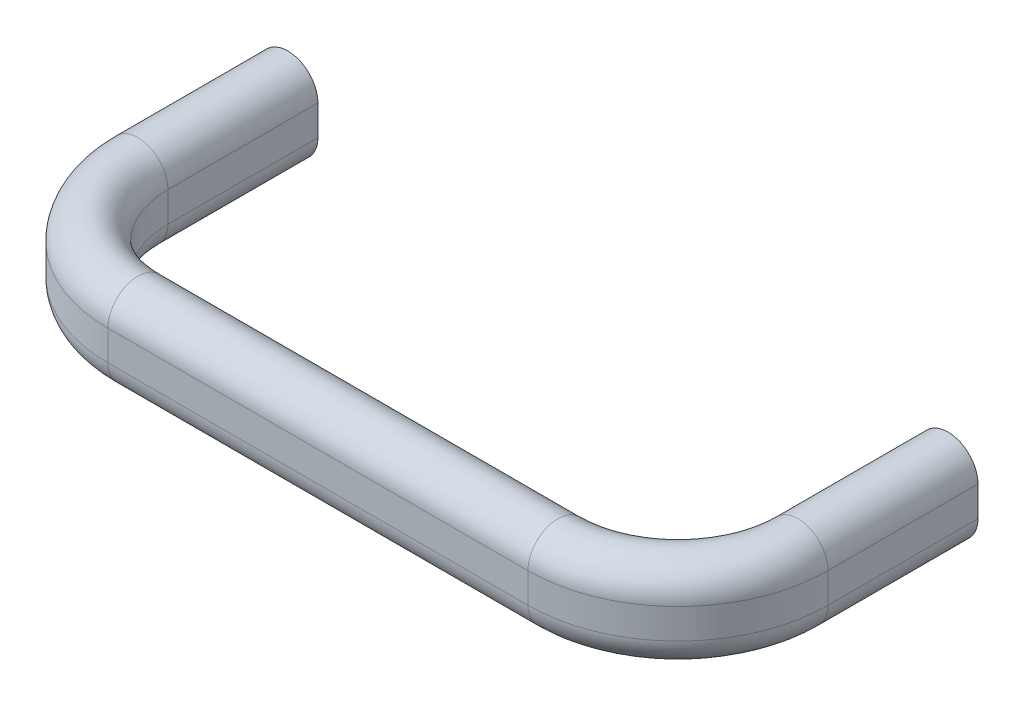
ISO-10303-21;
HEADER;
FILE_DESCRIPTION(('STEP AP214'),'2;1');
FILE_NAME('part.step','',(''),(''),'','','');
FILE_SCHEMA(('AUTOMOTIVE_DESIGN { 1 0 10303 214 1 1 1 1 }'));
ENDSEC;
DATA;
#1=APPLICATION_CONTEXT('core data for automotive mechanical design processes');
#2=APPLICATION_PROTOCOL_DEFINITION('international standard','automotive_design',2000,#1);
#3=PRODUCT_CONTEXT('',#1,'mechanical');
#4=PRODUCT('Part','Part','',(#3));
#5=PRODUCT_RELATED_PRODUCT_CATEGORY('part','',(#4));
#6=PRODUCT_DEFINITION_FORMATION('','',#4);
#7=PRODUCT_DEFINITION_CONTEXT('part definition',#1,'design');
#8=PRODUCT_DEFINITION('design','',#6,#7);
#9=PRODUCT_DEFINITION_SHAPE('','',#8);
#10=(LENGTH_UNIT() NAMED_UNIT(*) SI_UNIT(.MILLI.,.METRE.));
#11=(NAMED_UNIT(*) PLANE_ANGLE_UNIT() SI_UNIT($,.RADIAN.));
#12=(NAMED_UNIT(*) SI_UNIT($,.STERADIAN.) SOLID_ANGLE_UNIT());
#13=UNCERTAINTY_MEASURE_WITH_UNIT(LENGTH_MEASURE(1.E-05),#10,'distance_accuracy_value','');
#14=(GEOMETRIC_REPRESENTATION_CONTEXT(3) GLOBAL_UNCERTAINTY_ASSIGNED_CONTEXT((#13)) GLOBAL_UNIT_ASSIGNED_CONTEXT((#10,
#11,#12)) REPRESENTATION_CONTEXT('',''));
#15=CARTESIAN_POINT('',(0.,0.,0.));
#16=DIRECTION('',(0.,0.,1.));
#17=DIRECTION('',(1.,0.,0.));
#18=AXIS2_PLACEMENT_3D('',#15,#16,#17);
#19=CARTESIAN_POINT('',(0.,2.,0.));
#20=DIRECTION('',(0.,0.,-1.));
#21=DIRECTION('',(0.,1.,0.));
#22=AXIS2_PLACEMENT_3D('',#19,#20,#21);
#23=PLANE('',#22);
#24=CARTESIAN_POINT('',(0.,2.,0.));
#25=DIRECTION('',(0.,0.,-1.));
#26=DIRECTION('',(0.,1.,0.));
#27=AXIS2_PLACEMENT_3D('',#24,#25,#26);
#28=CIRCLE('',#27,4.);
#29=CARTESIAN_POINT('',(-4.,2.,0.));
#30=VERTEX_POINT('',#29);
#31=CARTESIAN_POINT('',(4.,2.,0.));
#32=VERTEX_POINT('',#31);
#33=EDGE_CURVE('E31',#30,#32,#28,.T.);
#34=ORIENTED_EDGE('',*,*,#33,.T.);
#35=DIRECTION('',(0.,-1.,0.));
#36=VECTOR('',#35,1.);
#37=CARTESIAN_POINT('',(4.,2.,0.));
#38=LINE('',#37,#36);
#39=CARTESIAN_POINT('',(4.,-2.,0.));
#40=VERTEX_POINT('',#39);
#41=EDGE_CURVE('E18',#32,#40,#38,.T.);
#42=ORIENTED_EDGE('',*,*,#41,.T.);
#43=CARTESIAN_POINT('',(0.,-2.,0.));
#44=DIRECTION('',(0.,0.,-1.));
#45=DIRECTION('',(0.,1.,0.));
#46=AXIS2_PLACEMENT_3D('',#43,#44,#45);
#47=CIRCLE('',#46,4.);
#48=CARTESIAN_POINT('',(-4.,-2.,0.));
#49=VERTEX_POINT('',#48);
#50=EDGE_CURVE('E39',#40,#49,#47,.T.);
#51=ORIENTED_EDGE('',*,*,#50,.T.);
#52=DIRECTION('',(0.,-1.,0.));
#53=VECTOR('',#52,1.);
#54=CARTESIAN_POINT('',(-4.,2.,0.));
#55=LINE('',#54,#53);
#56=EDGE_CURVE('E230',#30,#49,#55,.T.);
#57=ORIENTED_EDGE('',*,*,#56,.F.);
#58=EDGE_LOOP('',(#34,#42,#51,#57));
#59=FACE_BOUND('',#58,.T.);
#60=CARTESIAN_POINT('',(0.,0.,-2.23325047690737E-13));
#61=DIRECTION('',(0.,0.,-1.));
#62=DIRECTION('',(0.,1.,0.));
#63=AXIS2_PLACEMENT_3D('',#60,#61,#62);
#64=CIRCLE('',#63,2.96700000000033);
#65=CARTESIAN_POINT('',(0.,2.96700000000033,-2.23325047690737E-13));
#66=VERTEX_POINT('',#65);
#67=EDGE_CURVE('E542',#66,#66,#64,.T.);
#68=ORIENTED_EDGE('',*,*,#67,.F.);
#69=EDGE_LOOP('',(#68));
#70=FACE_BOUND('',#69,.T.);
#71=ADVANCED_FACE('F14',(#59,#70),#23,.T.);
#72=CARTESIAN_POINT('',(88.,2.,0.));
#73=DIRECTION('',(0.,0.,1.));
#74=DIRECTION('',(0.,1.,0.));
#75=AXIS2_PLACEMENT_3D('',#72,#73,#74);
#76=PLANE('',#75);
#77=CARTESIAN_POINT('',(88.,2.,0.));
#78=DIRECTION('',(0.,0.,1.));
#79=DIRECTION('',(0.,1.,0.));
#80=AXIS2_PLACEMENT_3D('',#77,#78,#79);
#81=CIRCLE('',#80,4.);
#82=CARTESIAN_POINT('',(92.,2.,0.));
#83=VERTEX_POINT('',#82);
#84=CARTESIAN_POINT('',(84.,2.,0.));
#85=VERTEX_POINT('',#84);
#86=EDGE_CURVE('E107',#83,#85,#81,.T.);
#87=ORIENTED_EDGE('',*,*,#86,.F.);
#88=DIRECTION('',(0.,-1.,0.));
#89=VECTOR('',#88,1.);
#90=CARTESIAN_POINT('',(92.,2.,0.));
#91=LINE('',#90,#89);
#92=CARTESIAN_POINT('',(92.,-2.,0.));
#93=VERTEX_POINT('',#92);
#94=EDGE_CURVE('E136',#83,#93,#91,.T.);
#95=ORIENTED_EDGE('',*,*,#94,.T.);
#96=CARTESIAN_POINT('',(88.,-2.,0.));
#97=DIRECTION('',(0.,0.,1.));
#98=DIRECTION('',(0.,1.,0.));
#99=AXIS2_PLACEMENT_3D('',#96,#97,#98);
#100=CIRCLE('',#99,4.);
#101=CARTESIAN_POINT('',(84.,-2.,0.));
#102=VERTEX_POINT('',#101);
#103=EDGE_CURVE('E134',#102,#93,#100,.T.);
#104=ORIENTED_EDGE('',*,*,#103,.F.);
#105=DIRECTION('',(0.,-1.,0.));
#106=VECTOR('',#105,1.);
#107=CARTESIAN_POINT('',(84.,2.,0.));
#108=LINE('',#107,#106);
#109=EDGE_CURVE('E119',#85,#102,#108,.T.);
#110=ORIENTED_EDGE('',*,*,#109,.F.);
#111=EDGE_LOOP('',(#87,#95,#104,#110));
#112=FACE_BOUND('',#111,.T.);
#113=CARTESIAN_POINT('',(88.,0.,-2.23325047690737E-13));
#114=DIRECTION('',(0.,0.,1.));
#115=DIRECTION('',(0.,1.,0.));
#116=AXIS2_PLACEMENT_3D('',#113,#114,#115);
#117=CIRCLE('',#116,2.96700000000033);
#118=CARTESIAN_POINT('',(88.,2.96700000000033,-2.23325047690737E-13));
#119=VERTEX_POINT('',#118);
#120=EDGE_CURVE('E120',#119,#119,#117,.T.);
#121=ORIENTED_EDGE('',*,*,#120,.T.);
#122=EDGE_LOOP('',(#121));
#123=FACE_BOUND('',#122,.T.);
#124=ADVANCED_FACE('F132',(#112,#123),#76,.F.);
#125=CARTESIAN_POINT('',(4.,2.,20.));
#126=DIRECTION('',(1.,0.,0.));
#127=DIRECTION('',(0.,1.,0.));
#128=AXIS2_PLACEMENT_3D('',#125,#126,#127);
#129=PLANE('',#128);
#130=DIRECTION('',(0.,-1.,0.));
#131=VECTOR('',#130,1.);
#132=CARTESIAN_POINT('',(4.,2.,20.));
#133=LINE('',#132,#131);
#134=CARTESIAN_POINT('',(4.,2.,20.));
#135=VERTEX_POINT('',#134);
#136=CARTESIAN_POINT('',(4.,-2.,20.));
#137=VERTEX_POINT('',#136);
#138=EDGE_CURVE('E204',#135,#137,#133,.T.);
#139=ORIENTED_EDGE('',*,*,#138,.T.);
#140=DIRECTION('',(0.,0.,-1.));
#141=VECTOR('',#140,1.);
#142=CARTESIAN_POINT('',(4.,-2.,20.));
#143=LINE('',#142,#141);
#144=EDGE_CURVE('E23',#137,#40,#143,.T.);
#145=ORIENTED_EDGE('',*,*,#144,.T.);
#146=ORIENTED_EDGE('',*,*,#41,.F.);
#147=DIRECTION('',(0.,0.,-1.));
#148=VECTOR('',#147,1.);
#149=CARTESIAN_POINT('',(4.,2.,20.));
#150=LINE('',#149,#148);
#151=EDGE_CURVE('E9',#135,#32,#150,.T.);
#152=ORIENTED_EDGE('',*,*,#151,.F.);
#153=EDGE_LOOP('',(#139,#145,#146,#152));
#154=FACE_BOUND('',#153,.T.);
#155=ADVANCED_FACE('F16',(#154),#129,.T.);
#156=CARTESIAN_POINT('',(0.,-2.,20.));
#157=DIRECTION('',(0.,0.,-1.));
#158=DIRECTION('',(0.,-1.,0.));
#159=AXIS2_PLACEMENT_3D('',#156,#157,#158);
#160=CYLINDRICAL_SURFACE('',#159,4.);
#161=CARTESIAN_POINT('',(0.,-2.,20.));
#162=DIRECTION('',(0.,0.,-1.));
#163=DIRECTION('',(0.,1.,0.));
#164=AXIS2_PLACEMENT_3D('',#161,#162,#163);
#165=CIRCLE('',#164,4.);
#166=CARTESIAN_POINT('',(-4.,-2.,20.));
#167=VERTEX_POINT('',#166);
#168=EDGE_CURVE('E217',#137,#167,#165,.T.);
#169=ORIENTED_EDGE('',*,*,#168,.T.);
#170=DIRECTION('',(0.,0.,-1.));
#171=VECTOR('',#170,1.);
#172=CARTESIAN_POINT('',(-4.,-2.,20.));
#173=LINE('',#172,#171);
#174=EDGE_CURVE('E225',#167,#49,#173,.T.);
#175=ORIENTED_EDGE('',*,*,#174,.T.);
#176=ORIENTED_EDGE('',*,*,#50,.F.);
#177=ORIENTED_EDGE('',*,*,#144,.F.);
#178=EDGE_LOOP('',(#169,#175,#176,#177));
#179=FACE_BOUND('',#178,.T.);
#180=ADVANCED_FACE('F235',(#179),#160,.T.);
#181=CARTESIAN_POINT('',(-4.,2.,20.));
#182=DIRECTION('',(1.,0.,0.));
#183=DIRECTION('',(0.,1.,0.));
#184=AXIS2_PLACEMENT_3D('',#181,#182,#183);
#185=PLANE('',#184);
#186=DIRECTION('',(0.,-1.,0.));
#187=VECTOR('',#186,1.);
#188=CARTESIAN_POINT('',(-4.,2.,20.));
#189=LINE('',#188,#187);
#190=CARTESIAN_POINT('',(-4.,2.,20.));
#191=VERTEX_POINT('',#190);
#192=EDGE_CURVE('E214',#191,#167,#189,.T.);
#193=ORIENTED_EDGE('',*,*,#192,.F.);
#194=DIRECTION('',(0.,0.,-1.));
#195=VECTOR('',#194,1.);
#196=CARTESIAN_POINT('',(-4.,2.,20.));
#197=LINE('',#196,#195);
#198=EDGE_CURVE('E222',#191,#30,#197,.T.);
#199=ORIENTED_EDGE('',*,*,#198,.T.);
#200=ORIENTED_EDGE('',*,*,#56,.T.);
#201=ORIENTED_EDGE('',*,*,#174,.F.);
#202=EDGE_LOOP('',(#193,#199,#200,#201));
#203=FACE_BOUND('',#202,.T.);
#204=ADVANCED_FACE('F292',(#203),#185,.F.);
#205=CARTESIAN_POINT('',(0.,2.,20.));
#206=DIRECTION('',(0.,0.,-1.));
#207=DIRECTION('',(0.,-1.,0.));
#208=AXIS2_PLACEMENT_3D('',#205,#206,#207);
#209=CYLINDRICAL_SURFACE('',#208,4.);
#210=CARTESIAN_POINT('',(0.,2.,20.));
#211=DIRECTION('',(0.,0.,-1.));
#212=DIRECTION('',(0.,1.,0.));
#213=AXIS2_PLACEMENT_3D('',#210,#211,#212);
#214=CIRCLE('',#213,4.);
#215=EDGE_CURVE('E190',#191,#135,#214,.T.);
#216=ORIENTED_EDGE('',*,*,#215,.T.);
#217=ORIENTED_EDGE('',*,*,#151,.T.);
#218=ORIENTED_EDGE('',*,*,#33,.F.);
#219=ORIENTED_EDGE('',*,*,#198,.F.);
#220=EDGE_LOOP('',(#216,#217,#218,#219));
#221=FACE_BOUND('',#220,.T.);
#222=ADVANCED_FACE('F283',(#221),#209,.T.);
#223=CARTESIAN_POINT('',(16.,0.,20.));
#224=DIRECTION('',(0.,-1.,0.));
#225=DIRECTION('',(1.,0.,0.));
#226=AXIS2_PLACEMENT_3D('',#223,#224,#225);
#227=CYLINDRICAL_SURFACE('',#226,12.);
#228=DIRECTION('',(0.,-1.,0.));
#229=VECTOR('',#228,1.);
#230=CARTESIAN_POINT('',(16.,2.,32.));
#231=LINE('',#230,#229);
#232=CARTESIAN_POINT('',(16.,2.,32.));
#233=VERTEX_POINT('',#232);
#234=CARTESIAN_POINT('',(16.,-2.,32.));
#235=VERTEX_POINT('',#234);
#236=EDGE_CURVE('E181',#233,#235,#231,.T.);
#237=ORIENTED_EDGE('',*,*,#236,.T.);
#238=CARTESIAN_POINT('',(16.,-2.,20.));
#239=DIRECTION('',(0.,-1.,0.));
#240=DIRECTION('',(1.,0.,0.));
#241=AXIS2_PLACEMENT_3D('',#238,#239,#240);
#242=CIRCLE('',#241,12.);
#243=EDGE_CURVE('E207',#235,#137,#242,.T.);
#244=ORIENTED_EDGE('',*,*,#243,.T.);
#245=ORIENTED_EDGE('',*,*,#138,.F.);
#246=CARTESIAN_POINT('',(16.,2.,20.));
#247=DIRECTION('',(0.,-1.,0.));
#248=DIRECTION('',(1.,0.,0.));
#249=AXIS2_PLACEMENT_3D('',#246,#247,#248);
#250=CIRCLE('',#249,12.);
#251=EDGE_CURVE('E210',#233,#135,#250,.T.);
#252=ORIENTED_EDGE('',*,*,#251,.F.);
#253=EDGE_LOOP('',(#237,#244,#245,#252));
#254=FACE_BOUND('',#253,.T.);
#255=ADVANCED_FACE('F281',(#254),#227,.F.);
#256=CARTESIAN_POINT('',(16.,-2.,20.));
#257=DIRECTION('',(0.,-1.,0.));
#258=DIRECTION('',(1.,0.,0.));
#259=AXIS2_PLACEMENT_3D('',#256,#257,#258);
#260=TOROIDAL_SURFACE('',#259,16.,4.);
#261=CARTESIAN_POINT('',(16.,-2.,36.));
#262=DIRECTION('',(-1.,0.,0.));
#263=DIRECTION('',(0.,1.,0.));
#264=AXIS2_PLACEMENT_3D('',#261,#262,#263);
#265=CIRCLE('',#264,4.);
#266=CARTESIAN_POINT('',(16.,-2.,40.));
#267=VERTEX_POINT('',#266);
#268=EDGE_CURVE('E195',#235,#267,#265,.T.);
#269=ORIENTED_EDGE('',*,*,#268,.T.);
#270=CARTESIAN_POINT('',(16.,-2.,20.));
#271=DIRECTION('',(0.,-1.,0.));
#272=DIRECTION('',(1.,0.,0.));
#273=AXIS2_PLACEMENT_3D('',#270,#271,#272);
#274=CIRCLE('',#273,20.);
#275=EDGE_CURVE('E203',#267,#167,#274,.T.);
#276=ORIENTED_EDGE('',*,*,#275,.T.);
#277=ORIENTED_EDGE('',*,*,#168,.F.);
#278=ORIENTED_EDGE('',*,*,#243,.F.);
#279=EDGE_LOOP('',(#269,#276,#277,#278));
#280=FACE_BOUND('',#279,.T.);
#281=ADVANCED_FACE('F244',(#280),#260,.T.);
#282=CARTESIAN_POINT('',(16.,0.,20.));
#283=DIRECTION('',(0.,-1.,0.));
#284=DIRECTION('',(1.,0.,0.));
#285=AXIS2_PLACEMENT_3D('',#282,#283,#284);
#286=CYLINDRICAL_SURFACE('',#285,20.);
#287=DIRECTION('',(0.,-1.,0.));
#288=VECTOR('',#287,1.);
#289=CARTESIAN_POINT('',(16.,2.,40.));
#290=LINE('',#289,#288);
#291=CARTESIAN_POINT('',(16.,2.,40.));
#292=VERTEX_POINT('',#291);
#293=EDGE_CURVE('E192',#292,#267,#290,.T.);
#294=ORIENTED_EDGE('',*,*,#293,.F.);
#295=CARTESIAN_POINT('',(16.,2.,20.));
#296=DIRECTION('',(0.,-1.,0.));
#297=DIRECTION('',(1.,0.,0.));
#298=AXIS2_PLACEMENT_3D('',#295,#296,#297);
#299=CIRCLE('',#298,20.);
#300=EDGE_CURVE('E200',#292,#191,#299,.T.);
#301=ORIENTED_EDGE('',*,*,#300,.T.);
#302=ORIENTED_EDGE('',*,*,#192,.T.);
#303=ORIENTED_EDGE('',*,*,#275,.F.);
#304=EDGE_LOOP('',(#294,#301,#302,#303));
#305=FACE_BOUND('',#304,.T.);
#306=ADVANCED_FACE('F241',(#305),#286,.T.);
#307=CARTESIAN_POINT('',(16.,2.,20.));
#308=DIRECTION('',(0.,-1.,0.));
#309=DIRECTION('',(1.,0.,0.));
#310=AXIS2_PLACEMENT_3D('',#307,#308,#309);
#311=TOROIDAL_SURFACE('',#310,16.,4.);
#312=CARTESIAN_POINT('',(16.,2.,36.));
#313=DIRECTION('',(-1.,0.,0.));
#314=DIRECTION('',(0.,1.,0.));
#315=AXIS2_PLACEMENT_3D('',#312,#313,#314);
#316=CIRCLE('',#315,4.);
#317=EDGE_CURVE('E167',#292,#233,#316,.T.);
#318=ORIENTED_EDGE('',*,*,#317,.T.);
#319=ORIENTED_EDGE('',*,*,#251,.T.);
#320=ORIENTED_EDGE('',*,*,#215,.F.);
#321=ORIENTED_EDGE('',*,*,#300,.F.);
#322=EDGE_LOOP('',(#318,#319,#320,#321));
#323=FACE_BOUND('',#322,.T.);
#324=ADVANCED_FACE('F279',(#323),#311,.T.);
#325=CARTESIAN_POINT('',(72.,2.,32.));
#326=DIRECTION('',(0.,0.,-1.));
#327=DIRECTION('',(-1.,0.,0.));
#328=AXIS2_PLACEMENT_3D('',#325,#326,#327);
#329=PLANE('',#328);
#330=DIRECTION('',(0.,-1.,0.));
#331=VECTOR('',#330,1.);
#332=CARTESIAN_POINT('',(72.,2.,32.));
#333=LINE('',#332,#331);
#334=CARTESIAN_POINT('',(72.,2.,32.));
#335=VERTEX_POINT('',#334);
#336=CARTESIAN_POINT('',(72.,-2.,32.));
#337=VERTEX_POINT('',#336);
#338=EDGE_CURVE('E158',#335,#337,#333,.T.);
#339=ORIENTED_EDGE('',*,*,#338,.T.);
#340=DIRECTION('',(-1.,0.,0.));
#341=VECTOR('',#340,1.);
#342=CARTESIAN_POINT('',(72.,-2.,32.));
#343=LINE('',#342,#341);
#344=EDGE_CURVE('E184',#337,#235,#343,.T.);
#345=ORIENTED_EDGE('',*,*,#344,.T.);
#346=ORIENTED_EDGE('',*,*,#236,.F.);
#347=DIRECTION('',(-1.,0.,0.));
#348=VECTOR('',#347,1.);
#349=CARTESIAN_POINT('',(72.,2.,32.));
#350=LINE('',#349,#348);
#351=EDGE_CURVE('E187',#335,#233,#350,.T.);
#352=ORIENTED_EDGE('',*,*,#351,.F.);
#353=EDGE_LOOP('',(#339,#345,#346,#352));
#354=FACE_BOUND('',#353,.T.);
#355=ADVANCED_FACE('F273',(#354),#329,.T.);
#356=CARTESIAN_POINT('',(72.,-2.,36.));
#357=DIRECTION('',(-1.,0.,0.));
#358=DIRECTION('',(0.,0.,1.));
#359=AXIS2_PLACEMENT_3D('',#356,#357,#358);
#360=CYLINDRICAL_SURFACE('',#359,4.);
#361=CARTESIAN_POINT('',(72.,-2.,36.));
#362=DIRECTION('',(-1.,0.,0.));
#363=DIRECTION('',(0.,1.,0.));
#364=AXIS2_PLACEMENT_3D('',#361,#362,#363);
#365=CIRCLE('',#364,4.);
#366=CARTESIAN_POINT('',(72.,-2.,40.));
#367=VERTEX_POINT('',#366);
#368=EDGE_CURVE('E172',#337,#367,#365,.T.);
#369=ORIENTED_EDGE('',*,*,#368,.T.);
#370=DIRECTION('',(-1.,0.,0.));
#371=VECTOR('',#370,1.);
#372=CARTESIAN_POINT('',(72.,-2.,40.));
#373=LINE('',#372,#371);
#374=EDGE_CURVE('E180',#367,#267,#373,.T.);
#375=ORIENTED_EDGE('',*,*,#374,.T.);
#376=ORIENTED_EDGE('',*,*,#268,.F.);
#377=ORIENTED_EDGE('',*,*,#344,.F.);
#378=EDGE_LOOP('',(#369,#375,#376,#377));
#379=FACE_BOUND('',#378,.T.);
#380=ADVANCED_FACE('F251',(#379),#360,.T.);
#381=CARTESIAN_POINT('',(72.,2.,40.));
#382=DIRECTION('',(0.,0.,-1.));
#383=DIRECTION('',(-1.,0.,0.));
#384=AXIS2_PLACEMENT_3D('',#381,#382,#383);
#385=PLANE('',#384);
#386=DIRECTION('',(0.,-1.,0.));
#387=VECTOR('',#386,1.);
#388=CARTESIAN_POINT('',(72.,2.,40.));
#389=LINE('',#388,#387);
#390=CARTESIAN_POINT('',(72.,2.,40.));
#391=VERTEX_POINT('',#390);
#392=EDGE_CURVE('E169',#391,#367,#389,.T.);
#393=ORIENTED_EDGE('',*,*,#392,.F.);
#394=DIRECTION('',(-1.,0.,0.));
#395=VECTOR('',#394,1.);
#396=CARTESIAN_POINT('',(72.,2.,40.));
#397=LINE('',#396,#395);
#398=EDGE_CURVE('E177',#391,#292,#397,.T.);
#399=ORIENTED_EDGE('',*,*,#398,.T.);
#400=ORIENTED_EDGE('',*,*,#293,.T.);
#401=ORIENTED_EDGE('',*,*,#374,.F.);
#402=EDGE_LOOP('',(#393,#399,#400,#401));
#403=FACE_BOUND('',#402,.T.);
#404=ADVANCED_FACE('F249',(#403),#385,.F.);
#405=CARTESIAN_POINT('',(72.,2.,36.));
#406=DIRECTION('',(-1.,0.,0.));
#407=DIRECTION('',(0.,0.,1.));
#408=AXIS2_PLACEMENT_3D('',#405,#406,#407);
#409=CYLINDRICAL_SURFACE('',#408,4.);
#410=CARTESIAN_POINT('',(72.,2.,36.));
#411=DIRECTION('',(-1.,0.,0.));
#412=DIRECTION('',(0.,1.,0.));
#413=AXIS2_PLACEMENT_3D('',#410,#411,#412);
#414=CIRCLE('',#413,4.);
#415=EDGE_CURVE('E129',#391,#335,#414,.T.);
#416=ORIENTED_EDGE('',*,*,#415,.T.);
#417=ORIENTED_EDGE('',*,*,#351,.T.);
#418=ORIENTED_EDGE('',*,*,#317,.F.);
#419=ORIENTED_EDGE('',*,*,#398,.F.);
#420=EDGE_LOOP('',(#416,#417,#418,#419));
#421=FACE_BOUND('',#420,.T.);
#422=ADVANCED_FACE('F276',(#421),#409,.T.);
#423=CARTESIAN_POINT('',(72.,0.,20.));
#424=DIRECTION('',(0.,-1.,0.));
#425=DIRECTION('',(1.,0.,0.));
#426=AXIS2_PLACEMENT_3D('',#423,#424,#425);
#427=CYLINDRICAL_SURFACE('',#426,12.);
#428=DIRECTION('',(0.,-1.,0.));
#429=VECTOR('',#428,1.);
#430=CARTESIAN_POINT('',(84.,2.,20.));
#431=LINE('',#430,#429);
#432=CARTESIAN_POINT('',(84.,2.,20.));
#433=VERTEX_POINT('',#432);
#434=CARTESIAN_POINT('',(84.,-2.,20.));
#435=VERTEX_POINT('',#434);
#436=EDGE_CURVE('E128',#433,#435,#431,.T.);
#437=ORIENTED_EDGE('',*,*,#436,.T.);
#438=CARTESIAN_POINT('',(72.,-2.,20.));
#439=DIRECTION('',(0.,-1.,0.));
#440=DIRECTION('',(1.,0.,0.));
#441=AXIS2_PLACEMENT_3D('',#438,#439,#440);
#442=CIRCLE('',#441,12.);
#443=EDGE_CURVE('E161',#435,#337,#442,.T.);
#444=ORIENTED_EDGE('',*,*,#443,.T.);
#445=ORIENTED_EDGE('',*,*,#338,.F.);
#446=CARTESIAN_POINT('',(72.,2.,20.));
#447=DIRECTION('',(0.,-1.,0.));
#448=DIRECTION('',(1.,0.,0.));
#449=AXIS2_PLACEMENT_3D('',#446,#447,#448);
#450=CIRCLE('',#449,12.);
#451=EDGE_CURVE('E164',#433,#335,#450,.T.);
#452=ORIENTED_EDGE('',*,*,#451,.F.);
#453=EDGE_LOOP('',(#437,#444,#445,#452));
#454=FACE_BOUND('',#453,.T.);
#455=ADVANCED_FACE('F270',(#454),#427,.F.);
#456=CARTESIAN_POINT('',(72.,-2.,20.));
#457=DIRECTION('',(0.,-1.,0.));
#458=DIRECTION('',(1.,0.,0.));
#459=AXIS2_PLACEMENT_3D('',#456,#457,#458);
#460=TOROIDAL_SURFACE('',#459,16.,4.);
#461=CARTESIAN_POINT('',(88.,-2.,20.));
#462=DIRECTION('',(0.,0.,1.));
#463=DIRECTION('',(0.,1.,0.));
#464=AXIS2_PLACEMENT_3D('',#461,#462,#463);
#465=CIRCLE('',#464,4.);
#466=CARTESIAN_POINT('',(92.,-2.,20.));
#467=VERTEX_POINT('',#466);
#468=EDGE_CURVE('E144',#435,#467,#465,.T.);
#469=ORIENTED_EDGE('',*,*,#468,.T.);
#470=CARTESIAN_POINT('',(72.,-2.,20.));
#471=DIRECTION('',(0.,-1.,0.));
#472=DIRECTION('',(1.,0.,0.));
#473=AXIS2_PLACEMENT_3D('',#470,#471,#472);
#474=CIRCLE('',#473,20.);
#475=EDGE_CURVE('E157',#467,#367,#474,.T.);
#476=ORIENTED_EDGE('',*,*,#475,.T.);
#477=ORIENTED_EDGE('',*,*,#368,.F.);
#478=ORIENTED_EDGE('',*,*,#443,.F.);
#479=EDGE_LOOP('',(#469,#476,#477,#478));
#480=FACE_BOUND('',#479,.T.);
#481=ADVANCED_FACE('F259',(#480),#460,.T.);
#482=CARTESIAN_POINT('',(72.,0.,20.));
#483=DIRECTION('',(0.,-1.,0.));
#484=DIRECTION('',(1.,0.,0.));
#485=AXIS2_PLACEMENT_3D('',#482,#483,#484);
#486=CYLINDRICAL_SURFACE('',#485,20.);
#487=DIRECTION('',(0.,-1.,0.));
#488=VECTOR('',#487,1.);
#489=CARTESIAN_POINT('',(92.,2.,20.));
#490=LINE('',#489,#488);
#491=CARTESIAN_POINT('',(92.,2.,20.));
#492=VERTEX_POINT('',#491);
#493=EDGE_CURVE('E146',#492,#467,#490,.T.);
#494=ORIENTED_EDGE('',*,*,#493,.F.);
#495=CARTESIAN_POINT('',(72.,2.,20.));
#496=DIRECTION('',(0.,-1.,0.));
#497=DIRECTION('',(1.,0.,0.));
#498=AXIS2_PLACEMENT_3D('',#495,#496,#497);
#499=CIRCLE('',#498,20.);
#500=EDGE_CURVE('E154',#492,#391,#499,.T.);
#501=ORIENTED_EDGE('',*,*,#500,.T.);
#502=ORIENTED_EDGE('',*,*,#392,.T.);
#503=ORIENTED_EDGE('',*,*,#475,.F.);
#504=EDGE_LOOP('',(#494,#501,#502,#503));
#505=FACE_BOUND('',#504,.T.);
#506=ADVANCED_FACE('F256',(#505),#486,.T.);
#507=CARTESIAN_POINT('',(72.,2.,20.));
#508=DIRECTION('',(0.,-1.,0.));
#509=DIRECTION('',(1.,0.,0.));
#510=AXIS2_PLACEMENT_3D('',#507,#508,#509);
#511=TOROIDAL_SURFACE('',#510,16.,4.);
#512=CARTESIAN_POINT('',(88.,2.,20.));
#513=DIRECTION('',(0.,0.,1.));
#514=DIRECTION('',(0.,1.,0.));
#515=AXIS2_PLACEMENT_3D('',#512,#513,#514);
#516=CIRCLE('',#515,4.);
#517=EDGE_CURVE('E141',#492,#433,#516,.T.);
#518=ORIENTED_EDGE('',*,*,#517,.T.);
#519=ORIENTED_EDGE('',*,*,#451,.T.);
#520=ORIENTED_EDGE('',*,*,#415,.F.);
#521=ORIENTED_EDGE('',*,*,#500,.F.);
#522=EDGE_LOOP('',(#518,#519,#520,#521));
#523=FACE_BOUND('',#522,.T.);
#524=ADVANCED_FACE('F267',(#523),#511,.T.);
#525=CARTESIAN_POINT('',(88.,2.,20.));
#526=DIRECTION('',(0.,0.,-1.));
#527=DIRECTION('',(0.,-1.,0.));
#528=AXIS2_PLACEMENT_3D('',#525,#526,#527);
#529=CYLINDRICAL_SURFACE('',#528,4.);
#530=DIRECTION('',(0.,0.,-1.));
#531=VECTOR('',#530,1.);
#532=CARTESIAN_POINT('',(84.,2.,20.));
#533=LINE('',#532,#531);
#534=EDGE_CURVE('E111',#433,#85,#533,.T.);
#535=ORIENTED_EDGE('',*,*,#534,.F.);
#536=ORIENTED_EDGE('',*,*,#517,.F.);
#537=DIRECTION('',(0.,0.,-1.));
#538=VECTOR('',#537,1.);
#539=CARTESIAN_POINT('',(92.,2.,20.));
#540=LINE('',#539,#538);
#541=EDGE_CURVE('E114',#492,#83,#540,.T.);
#542=ORIENTED_EDGE('',*,*,#541,.T.);
#543=ORIENTED_EDGE('',*,*,#86,.T.);
#544=EDGE_LOOP('',(#535,#536,#542,#543));
#545=FACE_BOUND('',#544,.T.);
#546=ADVANCED_FACE('F109',(#545),#529,.T.);
#547=CARTESIAN_POINT('',(84.,2.,20.));
#548=DIRECTION('',(1.,0.,0.));
#549=DIRECTION('',(0.,1.,0.));
#550=AXIS2_PLACEMENT_3D('',#547,#548,#549);
#551=PLANE('',#550);
#552=DIRECTION('',(0.,0.,-1.));
#553=VECTOR('',#552,1.);
#554=CARTESIAN_POINT('',(84.,-2.,20.));
#555=LINE('',#554,#553);
#556=EDGE_CURVE('E130',#435,#102,#555,.T.);
#557=ORIENTED_EDGE('',*,*,#556,.F.);
#558=ORIENTED_EDGE('',*,*,#436,.F.);
#559=ORIENTED_EDGE('',*,*,#534,.T.);
#560=ORIENTED_EDGE('',*,*,#109,.T.);
#561=EDGE_LOOP('',(#557,#558,#559,#560));
#562=FACE_BOUND('',#561,.T.);
#563=ADVANCED_FACE('F125',(#562),#551,.F.);
#564=CARTESIAN_POINT('',(88.,-2.,20.));
#565=DIRECTION('',(0.,0.,-1.));
#566=DIRECTION('',(0.,-1.,0.));
#567=AXIS2_PLACEMENT_3D('',#564,#565,#566);
#568=CYLINDRICAL_SURFACE('',#567,4.);
#569=DIRECTION('',(0.,0.,-1.));
#570=VECTOR('',#569,1.);
#571=CARTESIAN_POINT('',(92.,-2.,20.));
#572=LINE('',#571,#570);
#573=EDGE_CURVE('E150',#467,#93,#572,.T.);
#574=ORIENTED_EDGE('',*,*,#573,.F.);
#575=ORIENTED_EDGE('',*,*,#468,.F.);
#576=ORIENTED_EDGE('',*,*,#556,.T.);
#577=ORIENTED_EDGE('',*,*,#103,.T.);
#578=EDGE_LOOP('',(#574,#575,#576,#577));
#579=FACE_BOUND('',#578,.T.);
#580=ADVANCED_FACE('F262',(#579),#568,.T.);
#581=CARTESIAN_POINT('',(92.,2.,20.));
#582=DIRECTION('',(1.,0.,0.));
#583=DIRECTION('',(0.,1.,0.));
#584=AXIS2_PLACEMENT_3D('',#581,#582,#583);
#585=PLANE('',#584);
#586=ORIENTED_EDGE('',*,*,#493,.T.);
#587=ORIENTED_EDGE('',*,*,#573,.T.);
#588=ORIENTED_EDGE('',*,*,#94,.F.);
#589=ORIENTED_EDGE('',*,*,#541,.F.);
#590=EDGE_LOOP('',(#586,#587,#588,#589));
#591=FACE_BOUND('',#590,.T.);
#592=ADVANCED_FACE('F264',(#591),#585,.T.);
#593=CARTESIAN_POINT('',(88.,0.,-2.23325047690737E-13));
#594=DIRECTION('',(0.,0.,-1.));
#595=DIRECTION('',(0.,-1.,0.));
#596=AXIS2_PLACEMENT_3D('',#593,#594,#595);
#597=CONICAL_SURFACE('',#596,2.96700000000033,0.785398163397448);
#598=CARTESIAN_POINT('',(88.,0.,0.467000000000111));
#599=DIRECTION('',(0.,0.,-1.));
#600=DIRECTION('',(-1.,0.,0.));
#601=AXIS2_PLACEMENT_3D('',#598,#599,#600);
#602=CIRCLE('',#601,2.5);
#603=CARTESIAN_POINT('',(85.5,0.,0.467000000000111));
#604=VERTEX_POINT('',#603);
#605=EDGE_CURVE('E539',#604,#604,#602,.T.);
#606=ORIENTED_EDGE('',*,*,#605,.F.);
#607=EDGE_LOOP('',(#606));
#608=FACE_BOUND('',#607,.T.);
#609=ORIENTED_EDGE('',*,*,#120,.F.);
#610=EDGE_LOOP('',(#609));
#611=FACE_BOUND('',#610,.T.);
#612=ADVANCED_FACE('F306',(#608,#611),#597,.F.);
#613=CARTESIAN_POINT('',(0.,0.,-2.23325047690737E-13));
#614=DIRECTION('',(0.,0.,-1.));
#615=DIRECTION('',(0.,-1.,0.));
#616=AXIS2_PLACEMENT_3D('',#613,#614,#615);
#617=CONICAL_SURFACE('',#616,2.96700000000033,0.785398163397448);
#618=CARTESIAN_POINT('',(0.,0.,0.467000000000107));
#619=DIRECTION('',(0.,0.,-1.));
#620=DIRECTION('',(-1.,0.,0.));
#621=AXIS2_PLACEMENT_3D('',#618,#619,#620);
#622=CIRCLE('',#621,2.5);
#623=CARTESIAN_POINT('',(-2.5,0.,0.467000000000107));
#624=VERTEX_POINT('',#623);
#625=EDGE_CURVE('E531',#624,#624,#622,.T.);
#626=ORIENTED_EDGE('',*,*,#625,.F.);
#627=EDGE_LOOP('',(#626));
#628=FACE_BOUND('',#627,.T.);
#629=ORIENTED_EDGE('',*,*,#67,.T.);
#630=EDGE_LOOP('',(#629));
#631=FACE_BOUND('',#630,.T.);
#632=ADVANCED_FACE('F414',(#628,#631),#617,.F.);
#633=CARTESIAN_POINT('',(88.,0.,10.));
#634=DIRECTION('',(0.,0.,-1.));
#635=DIRECTION('',(-1.,0.,0.));
#636=AXIS2_PLACEMENT_3D('',#633,#634,#635);
#637=CYLINDRICAL_SURFACE('',#636,2.5);
#638=ORIENTED_EDGE('',*,*,#605,.T.);
#639=EDGE_LOOP('',(#638));
#640=FACE_BOUND('',#639,.T.);
#641=CARTESIAN_POINT('',(88.,0.,10.));
#642=DIRECTION('',(0.,0.,-1.));
#643=DIRECTION('',(-1.,0.,0.));
#644=AXIS2_PLACEMENT_3D('',#641,#642,#643);
#645=CIRCLE('',#644,2.5);
#646=CARTESIAN_POINT('',(85.5,0.,10.));
#647=VERTEX_POINT('',#646);
#648=EDGE_CURVE('E534',#647,#647,#645,.T.);
#649=ORIENTED_EDGE('',*,*,#648,.F.);
#650=EDGE_LOOP('',(#649));
#651=FACE_BOUND('',#650,.T.);
#652=ADVANCED_FACE('F422',(#640,#651),#637,.F.);
#653=CARTESIAN_POINT('',(88.,0.,10.));
#654=DIRECTION('',(0.,0.,-1.));
#655=DIRECTION('',(-1.,0.,0.));
#656=AXIS2_PLACEMENT_3D('',#653,#654,#655);
#657=PLANE('',#656);
#658=ORIENTED_EDGE('',*,*,#648,.T.);
#659=EDGE_LOOP('',(#658));
#660=FACE_BOUND('',#659,.T.);
#661=ADVANCED_FACE('F431',(#660),#657,.T.);
#662=CARTESIAN_POINT('',(0.,0.,10.));
#663=DIRECTION('',(0.,0.,-1.));
#664=DIRECTION('',(-1.,0.,0.));
#665=AXIS2_PLACEMENT_3D('',#662,#663,#664);
#666=CYLINDRICAL_SURFACE('',#665,2.5);
#667=ORIENTED_EDGE('',*,*,#625,.T.);
#668=EDGE_LOOP('',(#667));
#669=FACE_BOUND('',#668,.T.);
#670=CARTESIAN_POINT('',(0.,0.,10.));
#671=DIRECTION('',(0.,0.,-1.));
#672=DIRECTION('',(-1.,0.,0.));
#673=AXIS2_PLACEMENT_3D('',#670,#671,#672);
#674=CIRCLE('',#673,2.5);
#675=CARTESIAN_POINT('',(-2.5,0.,10.));
#676=VERTEX_POINT('',#675);
#677=EDGE_CURVE('E529',#676,#676,#674,.T.);
#678=ORIENTED_EDGE('',*,*,#677,.F.);
#679=EDGE_LOOP('',(#678));
#680=FACE_BOUND('',#679,.T.);
#681=ADVANCED_FACE('F440',(#669,#680),#666,.F.);
#682=CARTESIAN_POINT('',(0.,0.,10.));
#683=DIRECTION('',(0.,0.,-1.));
#684=DIRECTION('',(-1.,0.,0.));
#685=AXIS2_PLACEMENT_3D('',#682,#683,#684);
#686=PLANE('',#685);
#687=ORIENTED_EDGE('',*,*,#677,.T.);
#688=EDGE_LOOP('',(#687));
#689=FACE_BOUND('',#688,.T.);
#690=ADVANCED_FACE('F449',(#689),#686,.T.);
#691=CLOSED_SHELL('',(#71,#124,#155,#180,#204,#222,#255,#281,#306,#324,#355,#380,#404,#422,#455,
#481,#506,#524,#546,#563,#580,#592,#612,#632,#652,#661,#681,#690));
#692=MANIFOLD_SOLID_BREP('B1',#691);
#693=ADVANCED_BREP_SHAPE_REPRESENTATION('',(#18,#692),#14);
#694=SHAPE_DEFINITION_REPRESENTATION(#9,#693);
ENDSEC;
END-ISO-10303-21;
